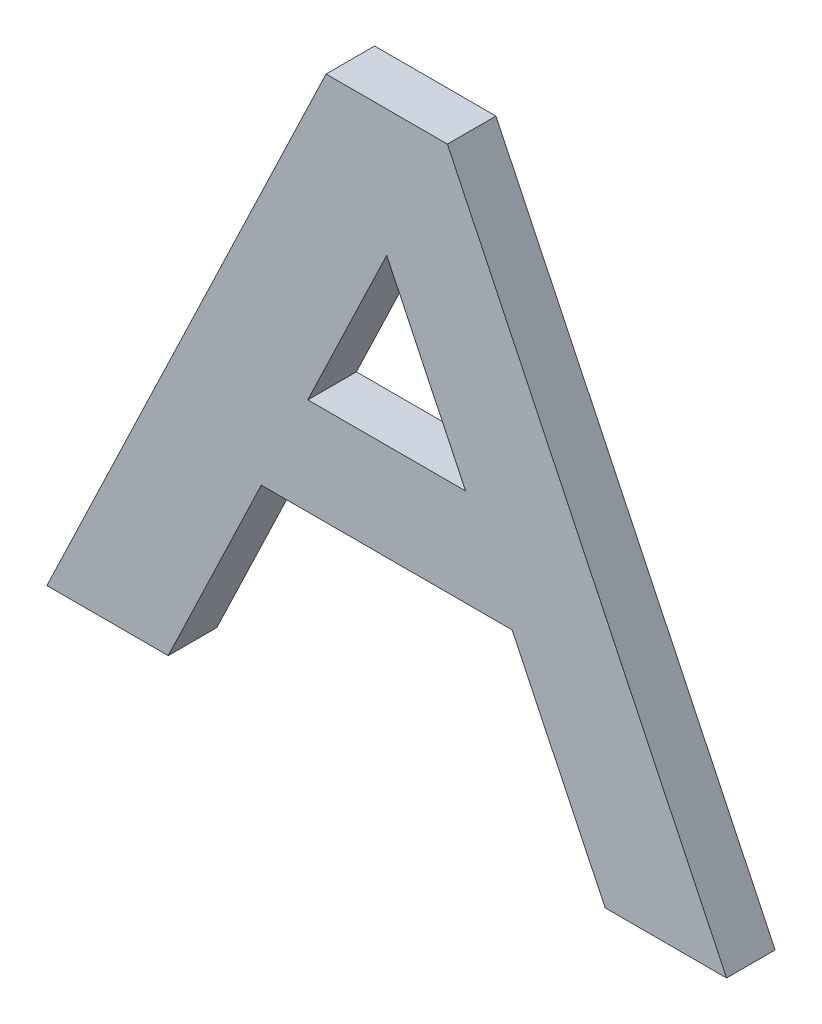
ISO-10303-21;
HEADER;
FILE_DESCRIPTION(('STEP AP214'),'2;1');
FILE_NAME('part.step','',(''),(''),'','','');
FILE_SCHEMA(('AUTOMOTIVE_DESIGN { 1 0 10303 214 1 1 1 1 }'));
ENDSEC;
DATA;
#1=APPLICATION_CONTEXT('core data for automotive mechanical design processes');
#2=APPLICATION_PROTOCOL_DEFINITION('international standard','automotive_design',2000,#1);
#3=PRODUCT_CONTEXT('',#1,'mechanical');
#4=PRODUCT('Part','Part','',(#3));
#5=PRODUCT_RELATED_PRODUCT_CATEGORY('part','',(#4));
#6=PRODUCT_DEFINITION_FORMATION('','',#4);
#7=PRODUCT_DEFINITION_CONTEXT('part definition',#1,'design');
#8=PRODUCT_DEFINITION('design','',#6,#7);
#9=PRODUCT_DEFINITION_SHAPE('','',#8);
#10=(LENGTH_UNIT() NAMED_UNIT(*) SI_UNIT(.MILLI.,.METRE.));
#11=(NAMED_UNIT(*) PLANE_ANGLE_UNIT() SI_UNIT($,.RADIAN.));
#12=(NAMED_UNIT(*) SI_UNIT($,.STERADIAN.) SOLID_ANGLE_UNIT());
#13=UNCERTAINTY_MEASURE_WITH_UNIT(LENGTH_MEASURE(1.E-05),#10,'distance_accuracy_value','');
#14=(GEOMETRIC_REPRESENTATION_CONTEXT(3) GLOBAL_UNCERTAINTY_ASSIGNED_CONTEXT((#13)) GLOBAL_UNIT_ASSIGNED_CONTEXT((#10,
#11,#12)) REPRESENTATION_CONTEXT('',''));
#15=CARTESIAN_POINT('',(0.,0.,0.));
#16=DIRECTION('',(0.,0.,1.));
#17=DIRECTION('',(1.,0.,0.));
#18=AXIS2_PLACEMENT_3D('',#15,#16,#17);
#19=CARTESIAN_POINT('',(-28.575,0.,6.35));
#20=DIRECTION('',(0.,0.,-1.));
#21=DIRECTION('',(-1.,0.,0.));
#22=AXIS2_PLACEMENT_3D('',#19,#20,#21);
#23=PLANE('',#22);
#24=DIRECTION('',(1.,0.,0.));
#25=VECTOR('',#24,1.);
#26=CARTESIAN_POINT('',(44.45,0.,6.35));
#27=LINE('',#26,#25);
#28=CARTESIAN_POINT('',(28.575,0.,6.35));
#29=VERTEX_POINT('',#28);
#30=CARTESIAN_POINT('',(44.45,0.,6.35));
#31=VERTEX_POINT('',#30);
#32=EDGE_CURVE('E142',#29,#31,#27,.T.);
#33=ORIENTED_EDGE('',*,*,#32,.T.);
#34=DIRECTION('',(-0.432120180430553,0.901816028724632,0.));
#35=VECTOR('',#34,1.);
#36=CARTESIAN_POINT('',(7.9375,76.2,6.35));
#37=LINE('',#36,#35);
#38=CARTESIAN_POINT('',(7.9375,76.2,6.35));
#39=VERTEX_POINT('',#38);
#40=EDGE_CURVE('E145',#31,#39,#37,.T.);
#41=ORIENTED_EDGE('',*,*,#40,.T.);
#42=DIRECTION('',(-1.,0.,0.));
#43=VECTOR('',#42,1.);
#44=CARTESIAN_POINT('',(-7.9375,76.2,6.35));
#45=LINE('',#44,#43);
#46=CARTESIAN_POINT('',(-7.9375,76.2,6.35));
#47=VERTEX_POINT('',#46);
#48=EDGE_CURVE('E148',#39,#47,#45,.T.);
#49=ORIENTED_EDGE('',*,*,#48,.T.);
#50=DIRECTION('',(-0.432120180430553,-0.901816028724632,0.));
#51=VECTOR('',#50,1.);
#52=CARTESIAN_POINT('',(-7.9375,76.2,6.35));
#53=LINE('',#52,#51);
#54=CARTESIAN_POINT('',(-44.45,0.,6.35));
#55=VERTEX_POINT('',#54);
#56=EDGE_CURVE('E150',#47,#55,#53,.T.);
#57=ORIENTED_EDGE('',*,*,#56,.T.);
#58=DIRECTION('',(1.,0.,0.));
#59=VECTOR('',#58,1.);
#60=CARTESIAN_POINT('',(-44.45,0.,6.35));
#61=LINE('',#60,#59);
#62=CARTESIAN_POINT('',(-28.575,0.,6.35));
#63=VERTEX_POINT('',#62);
#64=EDGE_CURVE('E152',#55,#63,#61,.T.);
#65=ORIENTED_EDGE('',*,*,#64,.T.);
#66=DIRECTION('',(0.432120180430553,0.901816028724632,0.));
#67=VECTOR('',#66,1.);
#68=CARTESIAN_POINT('',(-28.575,0.,6.35));
#69=LINE('',#68,#67);
#70=CARTESIAN_POINT('',(-16.4041666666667,25.4,6.35));
#71=VERTEX_POINT('',#70);
#72=EDGE_CURVE('E154',#63,#71,#69,.T.);
#73=ORIENTED_EDGE('',*,*,#72,.T.);
#74=DIRECTION('',(1.,0.,0.));
#75=VECTOR('',#74,1.);
#76=CARTESIAN_POINT('',(16.4041666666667,25.4,6.35));
#77=LINE('',#76,#75);
#78=CARTESIAN_POINT('',(16.4041666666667,25.4,6.35));
#79=VERTEX_POINT('',#78);
#80=EDGE_CURVE('E156',#71,#79,#77,.T.);
#81=ORIENTED_EDGE('',*,*,#80,.T.);
#82=DIRECTION('',(0.432120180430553,-0.901816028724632,0.));
#83=VECTOR('',#82,1.);
#84=CARTESIAN_POINT('',(28.575,0.,6.35));
#85=LINE('',#84,#83);
#86=EDGE_CURVE('E158',#79,#29,#85,.T.);
#87=ORIENTED_EDGE('',*,*,#86,.T.);
#88=EDGE_LOOP('',(#33,#41,#49,#57,#65,#73,#81,#87));
#89=FACE_BOUND('',#88,.T.);
#90=DIRECTION('',(-0.432120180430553,-0.901816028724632,0.));
#91=VECTOR('',#90,1.);
#92=CARTESIAN_POINT('',(0.,59.6347826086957,6.35));
#93=LINE('',#92,#91);
#94=CARTESIAN_POINT('',(0.,59.6347826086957,6.35));
#95=VERTEX_POINT('',#94);
#96=CARTESIAN_POINT('',(-10.31875,38.1,6.35));
#97=VERTEX_POINT('',#96);
#98=EDGE_CURVE('E115',#95,#97,#93,.T.);
#99=ORIENTED_EDGE('',*,*,#98,.F.);
#100=DIRECTION('',(-0.432120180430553,0.901816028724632,0.));
#101=VECTOR('',#100,1.);
#102=CARTESIAN_POINT('',(0.,59.6347826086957,6.35));
#103=LINE('',#102,#101);
#104=CARTESIAN_POINT('',(10.31875,38.1,6.35));
#105=VERTEX_POINT('',#104);
#106=EDGE_CURVE('E132',#105,#95,#103,.T.);
#107=ORIENTED_EDGE('',*,*,#106,.F.);
#108=DIRECTION('',(1.,0.,0.));
#109=VECTOR('',#108,1.);
#110=CARTESIAN_POINT('',(10.31875,38.1,6.35));
#111=LINE('',#110,#109);
#112=EDGE_CURVE('E123',#97,#105,#111,.T.);
#113=ORIENTED_EDGE('',*,*,#112,.F.);
#114=EDGE_LOOP('',(#99,#107,#113));
#115=FACE_BOUND('',#114,.T.);
#116=ADVANCED_FACE('F32',(#89,#115),#23,.F.);
#117=CARTESIAN_POINT('',(-28.575,0.,0.));
#118=DIRECTION('',(0.,0.,-1.));
#119=DIRECTION('',(-1.,0.,0.));
#120=AXIS2_PLACEMENT_3D('',#117,#118,#119);
#121=PLANE('',#120);
#122=DIRECTION('',(1.,0.,0.));
#123=VECTOR('',#122,1.);
#124=CARTESIAN_POINT('',(44.45,0.,0.));
#125=LINE('',#124,#123);
#126=CARTESIAN_POINT('',(28.575,0.,0.));
#127=VERTEX_POINT('',#126);
#128=CARTESIAN_POINT('',(44.45,0.,0.));
#129=VERTEX_POINT('',#128);
#130=EDGE_CURVE('E130',#127,#129,#125,.T.);
#131=ORIENTED_EDGE('',*,*,#130,.F.);
#132=DIRECTION('',(0.432120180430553,-0.901816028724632,0.));
#133=VECTOR('',#132,1.);
#134=CARTESIAN_POINT('',(28.575,0.,0.));
#135=LINE('',#134,#133);
#136=CARTESIAN_POINT('',(16.4041666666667,25.4,0.));
#137=VERTEX_POINT('',#136);
#138=EDGE_CURVE('E146',#137,#127,#135,.T.);
#139=ORIENTED_EDGE('',*,*,#138,.F.);
#140=DIRECTION('',(1.,0.,0.));
#141=VECTOR('',#140,1.);
#142=CARTESIAN_POINT('',(16.4041666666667,25.4,0.));
#143=LINE('',#142,#141);
#144=CARTESIAN_POINT('',(-16.4041666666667,25.4,0.));
#145=VERTEX_POINT('',#144);
#146=EDGE_CURVE('E173',#145,#137,#143,.T.);
#147=ORIENTED_EDGE('',*,*,#146,.F.);
#148=DIRECTION('',(0.432120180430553,0.901816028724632,0.));
#149=VECTOR('',#148,1.);
#150=CARTESIAN_POINT('',(-28.575,0.,0.));
#151=LINE('',#150,#149);
#152=CARTESIAN_POINT('',(-28.575,0.,0.));
#153=VERTEX_POINT('',#152);
#154=EDGE_CURVE('E171',#153,#145,#151,.T.);
#155=ORIENTED_EDGE('',*,*,#154,.F.);
#156=DIRECTION('',(1.,0.,0.));
#157=VECTOR('',#156,1.);
#158=CARTESIAN_POINT('',(-44.45,0.,0.));
#159=LINE('',#158,#157);
#160=CARTESIAN_POINT('',(-44.45,0.,0.));
#161=VERTEX_POINT('',#160);
#162=EDGE_CURVE('E169',#161,#153,#159,.T.);
#163=ORIENTED_EDGE('',*,*,#162,.F.);
#164=DIRECTION('',(-0.432120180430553,-0.901816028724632,0.));
#165=VECTOR('',#164,1.);
#166=CARTESIAN_POINT('',(-7.9375,76.2,0.));
#167=LINE('',#166,#165);
#168=CARTESIAN_POINT('',(-7.9375,76.2,0.));
#169=VERTEX_POINT('',#168);
#170=EDGE_CURVE('E167',#169,#161,#167,.T.);
#171=ORIENTED_EDGE('',*,*,#170,.F.);
#172=DIRECTION('',(-1.,0.,0.));
#173=VECTOR('',#172,1.);
#174=CARTESIAN_POINT('',(-7.9375,76.2,0.));
#175=LINE('',#174,#173);
#176=CARTESIAN_POINT('',(7.9375,76.2,0.));
#177=VERTEX_POINT('',#176);
#178=EDGE_CURVE('E165',#177,#169,#175,.T.);
#179=ORIENTED_EDGE('',*,*,#178,.F.);
#180=DIRECTION('',(-0.432120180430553,0.901816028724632,0.));
#181=VECTOR('',#180,1.);
#182=CARTESIAN_POINT('',(7.9375,76.2,0.));
#183=LINE('',#182,#181);
#184=EDGE_CURVE('E163',#129,#177,#183,.T.);
#185=ORIENTED_EDGE('',*,*,#184,.F.);
#186=EDGE_LOOP('',(#131,#139,#147,#155,#163,#171,#179,#185));
#187=FACE_BOUND('',#186,.T.);
#188=DIRECTION('',(-0.432120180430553,0.901816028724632,0.));
#189=VECTOR('',#188,1.);
#190=CARTESIAN_POINT('',(0.,59.6347826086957,0.));
#191=LINE('',#190,#189);
#192=CARTESIAN_POINT('',(10.31875,38.1,0.));
#193=VERTEX_POINT('',#192);
#194=CARTESIAN_POINT('',(0.,59.6347826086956,0.));
#195=VERTEX_POINT('',#194);
#196=EDGE_CURVE('E124',#193,#195,#191,.T.);
#197=ORIENTED_EDGE('',*,*,#196,.T.);
#198=DIRECTION('',(-0.432120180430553,-0.901816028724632,0.));
#199=VECTOR('',#198,1.);
#200=CARTESIAN_POINT('',(0.,59.6347826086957,0.));
#201=LINE('',#200,#199);
#202=CARTESIAN_POINT('',(-10.31875,38.1,0.));
#203=VERTEX_POINT('',#202);
#204=EDGE_CURVE('E55',#195,#203,#201,.T.);
#205=ORIENTED_EDGE('',*,*,#204,.T.);
#206=DIRECTION('',(1.,0.,0.));
#207=VECTOR('',#206,1.);
#208=CARTESIAN_POINT('',(10.31875,38.1,0.));
#209=LINE('',#208,#207);
#210=EDGE_CURVE('E129',#203,#193,#209,.T.);
#211=ORIENTED_EDGE('',*,*,#210,.T.);
#212=EDGE_LOOP('',(#197,#205,#211));
#213=FACE_BOUND('',#212,.T.);
#214=ADVANCED_FACE('F203',(#187,#213),#121,.T.);
#215=CARTESIAN_POINT('',(44.45,0.,6.35));
#216=DIRECTION('',(0.,1.,0.));
#217=DIRECTION('',(-1.,0.,0.));
#218=AXIS2_PLACEMENT_3D('',#215,#216,#217);
#219=PLANE('',#218);
#220=ORIENTED_EDGE('',*,*,#130,.T.);
#221=DIRECTION('',(0.,0.,-1.));
#222=VECTOR('',#221,1.);
#223=CARTESIAN_POINT('',(44.45,0.,6.35));
#224=LINE('',#223,#222);
#225=EDGE_CURVE('E11',#31,#129,#224,.T.);
#226=ORIENTED_EDGE('',*,*,#225,.F.);
#227=ORIENTED_EDGE('',*,*,#32,.F.);
#228=DIRECTION('',(0.,0.,-1.));
#229=VECTOR('',#228,1.);
#230=CARTESIAN_POINT('',(28.575,0.,6.35));
#231=LINE('',#230,#229);
#232=EDGE_CURVE('E160',#29,#127,#231,.T.);
#233=ORIENTED_EDGE('',*,*,#232,.T.);
#234=EDGE_LOOP('',(#220,#226,#227,#233));
#235=FACE_BOUND('',#234,.T.);
#236=ADVANCED_FACE('F34',(#235),#219,.F.);
#237=CARTESIAN_POINT('',(7.9375,76.2,6.35));
#238=DIRECTION('',(-0.901816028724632,-0.432120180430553,0.));
#239=DIRECTION('',(0.432120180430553,-0.901816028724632,0.));
#240=AXIS2_PLACEMENT_3D('',#237,#238,#239);
#241=PLANE('',#240);
#242=ORIENTED_EDGE('',*,*,#184,.T.);
#243=DIRECTION('',(0.,0.,-1.));
#244=VECTOR('',#243,1.);
#245=CARTESIAN_POINT('',(7.9375,76.2,6.35));
#246=LINE('',#245,#244);
#247=EDGE_CURVE('E40',#39,#177,#246,.T.);
#248=ORIENTED_EDGE('',*,*,#247,.F.);
#249=ORIENTED_EDGE('',*,*,#40,.F.);
#250=ORIENTED_EDGE('',*,*,#225,.T.);
#251=EDGE_LOOP('',(#242,#248,#249,#250));
#252=FACE_BOUND('',#251,.T.);
#253=ADVANCED_FACE('F220',(#252),#241,.F.);
#254=CARTESIAN_POINT('',(-7.9375,76.2,6.35));
#255=DIRECTION('',(0.,-1.,0.));
#256=DIRECTION('',(0.,0.,-1.));
#257=AXIS2_PLACEMENT_3D('',#254,#255,#256);
#258=PLANE('',#257);
#259=ORIENTED_EDGE('',*,*,#178,.T.);
#260=DIRECTION('',(0.,0.,-1.));
#261=VECTOR('',#260,1.);
#262=CARTESIAN_POINT('',(-7.9375,76.2,6.35));
#263=LINE('',#262,#261);
#264=EDGE_CURVE('E190',#47,#169,#263,.T.);
#265=ORIENTED_EDGE('',*,*,#264,.F.);
#266=ORIENTED_EDGE('',*,*,#48,.F.);
#267=ORIENTED_EDGE('',*,*,#247,.T.);
#268=EDGE_LOOP('',(#259,#265,#266,#267));
#269=FACE_BOUND('',#268,.T.);
#270=ADVANCED_FACE('F197',(#269),#258,.F.);
#271=CARTESIAN_POINT('',(-7.9375,76.2,6.35));
#272=DIRECTION('',(0.901816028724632,-0.432120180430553,0.));
#273=DIRECTION('',(0.432120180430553,0.901816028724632,0.));
#274=AXIS2_PLACEMENT_3D('',#271,#272,#273);
#275=PLANE('',#274);
#276=ORIENTED_EDGE('',*,*,#170,.T.);
#277=DIRECTION('',(0.,0.,-1.));
#278=VECTOR('',#277,1.);
#279=CARTESIAN_POINT('',(-44.45,0.,6.35));
#280=LINE('',#279,#278);
#281=EDGE_CURVE('E187',#55,#161,#280,.T.);
#282=ORIENTED_EDGE('',*,*,#281,.F.);
#283=ORIENTED_EDGE('',*,*,#56,.F.);
#284=ORIENTED_EDGE('',*,*,#264,.T.);
#285=EDGE_LOOP('',(#276,#282,#283,#284));
#286=FACE_BOUND('',#285,.T.);
#287=ADVANCED_FACE('F209',(#286),#275,.F.);
#288=CARTESIAN_POINT('',(-44.45,0.,6.35));
#289=DIRECTION('',(0.,1.,0.));
#290=DIRECTION('',(-1.,0.,0.));
#291=AXIS2_PLACEMENT_3D('',#288,#289,#290);
#292=PLANE('',#291);
#293=ORIENTED_EDGE('',*,*,#162,.T.);
#294=DIRECTION('',(0.,0.,-1.));
#295=VECTOR('',#294,1.);
#296=CARTESIAN_POINT('',(-28.575,0.,6.35));
#297=LINE('',#296,#295);
#298=EDGE_CURVE('E184',#63,#153,#297,.T.);
#299=ORIENTED_EDGE('',*,*,#298,.F.);
#300=ORIENTED_EDGE('',*,*,#64,.F.);
#301=ORIENTED_EDGE('',*,*,#281,.T.);
#302=EDGE_LOOP('',(#293,#299,#300,#301));
#303=FACE_BOUND('',#302,.T.);
#304=ADVANCED_FACE('F213',(#303),#292,.F.);
#305=CARTESIAN_POINT('',(-28.575,0.,6.35));
#306=DIRECTION('',(-0.901816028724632,0.432120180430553,0.));
#307=DIRECTION('',(-0.432120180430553,-0.901816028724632,0.));
#308=AXIS2_PLACEMENT_3D('',#305,#306,#307);
#309=PLANE('',#308);
#310=ORIENTED_EDGE('',*,*,#154,.T.);
#311=DIRECTION('',(0.,0.,-1.));
#312=VECTOR('',#311,1.);
#313=CARTESIAN_POINT('',(-16.4041666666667,25.4,6.35));
#314=LINE('',#313,#312);
#315=EDGE_CURVE('E181',#71,#145,#314,.T.);
#316=ORIENTED_EDGE('',*,*,#315,.F.);
#317=ORIENTED_EDGE('',*,*,#72,.F.);
#318=ORIENTED_EDGE('',*,*,#298,.T.);
#319=EDGE_LOOP('',(#310,#316,#317,#318));
#320=FACE_BOUND('',#319,.T.);
#321=ADVANCED_FACE('F233',(#320),#309,.F.);
#322=CARTESIAN_POINT('',(16.4041666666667,25.4,6.35));
#323=DIRECTION('',(0.,1.,0.));
#324=DIRECTION('',(0.,0.,1.));
#325=AXIS2_PLACEMENT_3D('',#322,#323,#324);
#326=PLANE('',#325);
#327=ORIENTED_EDGE('',*,*,#146,.T.);
#328=DIRECTION('',(0.,0.,-1.));
#329=VECTOR('',#328,1.);
#330=CARTESIAN_POINT('',(16.4041666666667,25.4,6.35));
#331=LINE('',#330,#329);
#332=EDGE_CURVE('E178',#79,#137,#331,.T.);
#333=ORIENTED_EDGE('',*,*,#332,.F.);
#334=ORIENTED_EDGE('',*,*,#80,.F.);
#335=ORIENTED_EDGE('',*,*,#315,.T.);
#336=EDGE_LOOP('',(#327,#333,#334,#335));
#337=FACE_BOUND('',#336,.T.);
#338=ADVANCED_FACE('F231',(#337),#326,.F.);
#339=CARTESIAN_POINT('',(28.575,0.,6.35));
#340=DIRECTION('',(0.901816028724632,0.432120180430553,0.));
#341=DIRECTION('',(-0.432120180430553,0.901816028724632,0.));
#342=AXIS2_PLACEMENT_3D('',#339,#340,#341);
#343=PLANE('',#342);
#344=ORIENTED_EDGE('',*,*,#138,.T.);
#345=ORIENTED_EDGE('',*,*,#232,.F.);
#346=ORIENTED_EDGE('',*,*,#86,.F.);
#347=ORIENTED_EDGE('',*,*,#332,.T.);
#348=EDGE_LOOP('',(#344,#345,#346,#347));
#349=FACE_BOUND('',#348,.T.);
#350=ADVANCED_FACE('F226',(#349),#343,.F.);
#351=CARTESIAN_POINT('',(0.,59.6347826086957,6.35));
#352=DIRECTION('',(0.901816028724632,-0.432120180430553,0.));
#353=DIRECTION('',(0.432120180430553,0.901816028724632,0.));
#354=AXIS2_PLACEMENT_3D('',#351,#352,#353);
#355=PLANE('',#354);
#356=ORIENTED_EDGE('',*,*,#204,.F.);
#357=DIRECTION('',(0.,0.,-1.));
#358=VECTOR('',#357,1.);
#359=CARTESIAN_POINT('',(0.,59.6347826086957,6.35));
#360=LINE('',#359,#358);
#361=EDGE_CURVE('E119',#95,#195,#360,.T.);
#362=ORIENTED_EDGE('',*,*,#361,.F.);
#363=ORIENTED_EDGE('',*,*,#98,.T.);
#364=DIRECTION('',(0.,0.,-1.));
#365=VECTOR('',#364,1.);
#366=CARTESIAN_POINT('',(-10.31875,38.1,6.35));
#367=LINE('',#366,#365);
#368=EDGE_CURVE('E118',#97,#203,#367,.T.);
#369=ORIENTED_EDGE('',*,*,#368,.T.);
#370=EDGE_LOOP('',(#356,#362,#363,#369));
#371=FACE_BOUND('',#370,.T.);
#372=ADVANCED_FACE('F117',(#371),#355,.T.);
#373=CARTESIAN_POINT('',(10.31875,38.1,6.35));
#374=DIRECTION('',(0.,1.,0.));
#375=DIRECTION('',(0.,0.,1.));
#376=AXIS2_PLACEMENT_3D('',#373,#374,#375);
#377=PLANE('',#376);
#378=ORIENTED_EDGE('',*,*,#210,.F.);
#379=ORIENTED_EDGE('',*,*,#368,.F.);
#380=ORIENTED_EDGE('',*,*,#112,.T.);
#381=DIRECTION('',(0.,0.,-1.));
#382=VECTOR('',#381,1.);
#383=CARTESIAN_POINT('',(10.31875,38.1,6.35));
#384=LINE('',#383,#382);
#385=EDGE_CURVE('E47',#105,#193,#384,.T.);
#386=ORIENTED_EDGE('',*,*,#385,.T.);
#387=EDGE_LOOP('',(#378,#379,#380,#386));
#388=FACE_BOUND('',#387,.T.);
#389=ADVANCED_FACE('F127',(#388),#377,.T.);
#390=CARTESIAN_POINT('',(0.,59.6347826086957,6.35));
#391=DIRECTION('',(-0.901816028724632,-0.432120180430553,0.));
#392=DIRECTION('',(0.432120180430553,-0.901816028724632,0.));
#393=AXIS2_PLACEMENT_3D('',#390,#391,#392);
#394=PLANE('',#393);
#395=ORIENTED_EDGE('',*,*,#196,.F.);
#396=ORIENTED_EDGE('',*,*,#385,.F.);
#397=ORIENTED_EDGE('',*,*,#106,.T.);
#398=ORIENTED_EDGE('',*,*,#361,.T.);
#399=EDGE_LOOP('',(#395,#396,#397,#398));
#400=FACE_BOUND('',#399,.T.);
#401=ADVANCED_FACE('F258',(#400),#394,.T.);
#402=CLOSED_SHELL('',(#116,#214,#236,#253,#270,#287,#304,#321,#338,#350,#372,#389,#401));
#403=MANIFOLD_SOLID_BREP('B2',#402);
#404=ADVANCED_BREP_SHAPE_REPRESENTATION('',(#18,#403),#14);
#405=SHAPE_DEFINITION_REPRESENTATION(#9,#404);
ENDSEC;
END-ISO-10303-21;
